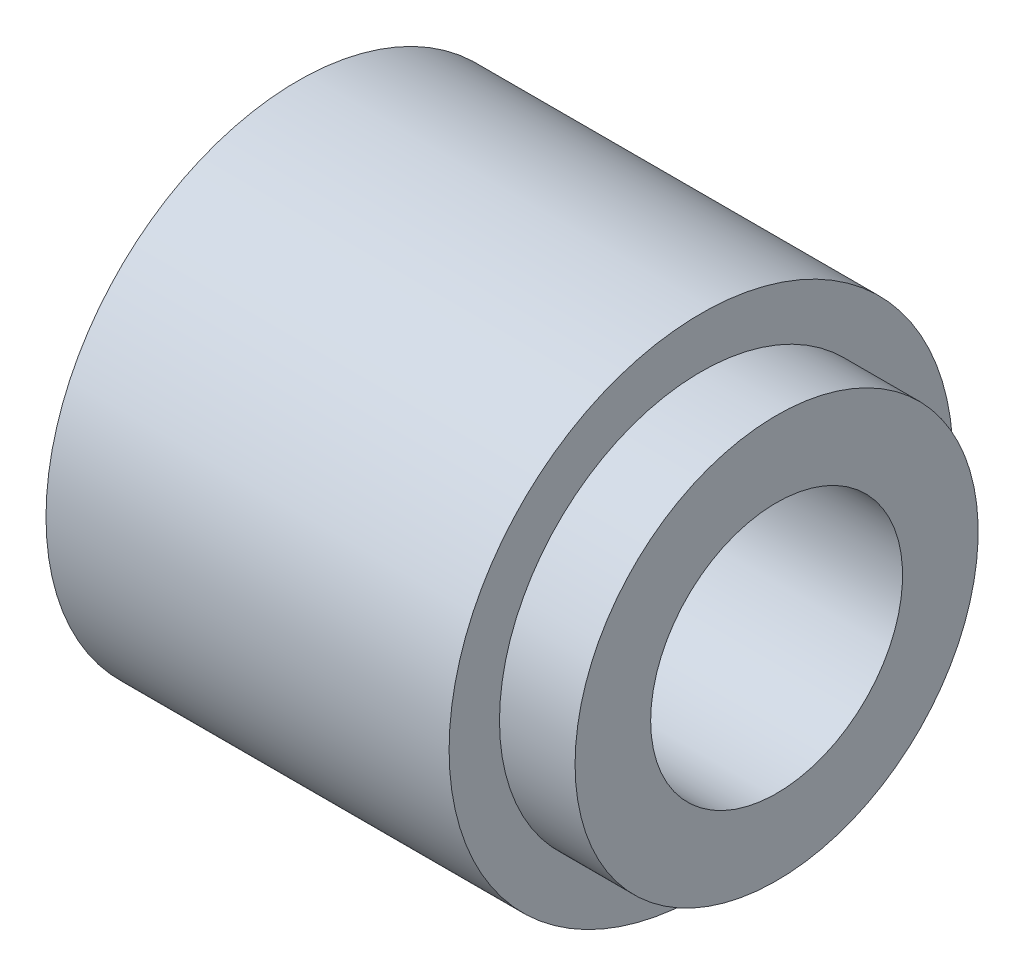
ISO-10303-21;
HEADER;
FILE_DESCRIPTION(('STEP AP214'),'2;1');
FILE_NAME('part.step','',(''),(''),'','','');
FILE_SCHEMA(('AUTOMOTIVE_DESIGN { 1 0 10303 214 1 1 1 1 }'));
ENDSEC;
DATA;
#1=APPLICATION_CONTEXT('core data for automotive mechanical design processes');
#2=APPLICATION_PROTOCOL_DEFINITION('international standard','automotive_design',2000,#1);
#3=PRODUCT_CONTEXT('',#1,'mechanical');
#4=PRODUCT('Part','Part','',(#3));
#5=PRODUCT_RELATED_PRODUCT_CATEGORY('part','',(#4));
#6=PRODUCT_DEFINITION_FORMATION('','',#4);
#7=PRODUCT_DEFINITION_CONTEXT('part definition',#1,'design');
#8=PRODUCT_DEFINITION('design','',#6,#7);
#9=PRODUCT_DEFINITION_SHAPE('','',#8);
#10=(LENGTH_UNIT() NAMED_UNIT(*) SI_UNIT(.MILLI.,.METRE.));
#11=(NAMED_UNIT(*) PLANE_ANGLE_UNIT() SI_UNIT($,.RADIAN.));
#12=(NAMED_UNIT(*) SI_UNIT($,.STERADIAN.) SOLID_ANGLE_UNIT());
#13=UNCERTAINTY_MEASURE_WITH_UNIT(LENGTH_MEASURE(1.E-05),#10,'distance_accuracy_value','');
#14=(GEOMETRIC_REPRESENTATION_CONTEXT(3) GLOBAL_UNCERTAINTY_ASSIGNED_CONTEXT((#13)) GLOBAL_UNIT_ASSIGNED_CONTEXT((#10,
#11,#12)) REPRESENTATION_CONTEXT('',''));
#15=CARTESIAN_POINT('',(0.,0.,0.));
#16=DIRECTION('',(0.,0.,1.));
#17=DIRECTION('',(1.,0.,0.));
#18=AXIS2_PLACEMENT_3D('',#15,#16,#17);
#19=CARTESIAN_POINT('',(0.,-5.99164590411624,0.));
#20=DIRECTION('',(1.,0.,0.));
#21=DIRECTION('',(0.,0.,-1.));
#22=AXIS2_PLACEMENT_3D('',#19,#20,#21);
#23=PLANE('',#22);
#24=CARTESIAN_POINT('',(0.,0.,0.));
#25=DIRECTION('',(-1.,0.,0.));
#26=DIRECTION('',(0.,0.,1.));
#27=AXIS2_PLACEMENT_3D('',#24,#25,#26);
#28=CIRCLE('',#27,2.5);
#29=CARTESIAN_POINT('',(0.,0.,2.5));
#30=VERTEX_POINT('',#29);
#31=EDGE_CURVE('E10',#30,#30,#28,.T.);
#32=ORIENTED_EDGE('',*,*,#31,.F.);
#33=EDGE_LOOP('',(#32));
#34=FACE_BOUND('',#33,.T.);
#35=CARTESIAN_POINT('',(0.,0.,0.));
#36=DIRECTION('',(-1.,0.,0.));
#37=DIRECTION('',(0.,0.,1.));
#38=AXIS2_PLACEMENT_3D('',#35,#36,#37);
#39=CIRCLE('',#38,5.);
#40=CARTESIAN_POINT('',(0.,0.,5.));
#41=VERTEX_POINT('',#40);
#42=EDGE_CURVE('E52',#41,#41,#39,.T.);
#43=ORIENTED_EDGE('',*,*,#42,.T.);
#44=EDGE_LOOP('',(#43));
#45=FACE_BOUND('',#44,.T.);
#46=ADVANCED_FACE('F30',(#34,#45),#23,.F.);
#47=CARTESIAN_POINT('',(0.,0.,0.));
#48=DIRECTION('',(-1.,0.,0.));
#49=DIRECTION('',(0.,0.,1.));
#50=AXIS2_PLACEMENT_3D('',#47,#48,#49);
#51=CYLINDRICAL_SURFACE('',#50,2.5);
#52=CARTESIAN_POINT('',(9.5,0.,0.));
#53=DIRECTION('',(-1.,0.,0.));
#54=DIRECTION('',(0.,0.,1.));
#55=AXIS2_PLACEMENT_3D('',#52,#53,#54);
#56=CIRCLE('',#55,2.5);
#57=CARTESIAN_POINT('',(9.5,0.,2.5));
#58=VERTEX_POINT('',#57);
#59=EDGE_CURVE('E36',#58,#58,#56,.T.);
#60=ORIENTED_EDGE('',*,*,#59,.F.);
#61=EDGE_LOOP('',(#60));
#62=FACE_BOUND('',#61,.T.);
#63=ORIENTED_EDGE('',*,*,#31,.T.);
#64=EDGE_LOOP('',(#63));
#65=FACE_BOUND('',#64,.T.);
#66=ADVANCED_FACE('F77',(#62,#65),#51,.F.);
#67=CARTESIAN_POINT('',(9.5,-5.99164590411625,0.));
#68=DIRECTION('',(-1.,0.,0.));
#69=DIRECTION('',(0.,0.,1.));
#70=AXIS2_PLACEMENT_3D('',#67,#68,#69);
#71=PLANE('',#70);
#72=CARTESIAN_POINT('',(9.5,0.,0.));
#73=DIRECTION('',(-1.,0.,0.));
#74=DIRECTION('',(0.,0.,1.));
#75=AXIS2_PLACEMENT_3D('',#72,#73,#74);
#76=CIRCLE('',#75,4.);
#77=CARTESIAN_POINT('',(9.5,0.,4.));
#78=VERTEX_POINT('',#77);
#79=EDGE_CURVE('E40',#78,#78,#76,.T.);
#80=ORIENTED_EDGE('',*,*,#79,.F.);
#81=EDGE_LOOP('',(#80));
#82=FACE_BOUND('',#81,.T.);
#83=ORIENTED_EDGE('',*,*,#59,.T.);
#84=EDGE_LOOP('',(#83));
#85=FACE_BOUND('',#84,.T.);
#86=ADVANCED_FACE('F72',(#82,#85),#71,.F.);
#87=CARTESIAN_POINT('',(0.,0.,0.));
#88=DIRECTION('',(-1.,0.,0.));
#89=DIRECTION('',(0.,0.,1.));
#90=AXIS2_PLACEMENT_3D('',#87,#88,#89);
#91=CYLINDRICAL_SURFACE('',#90,4.);
#92=CARTESIAN_POINT('',(8.,0.,0.));
#93=DIRECTION('',(-1.,0.,0.));
#94=DIRECTION('',(0.,0.,1.));
#95=AXIS2_PLACEMENT_3D('',#92,#93,#94);
#96=CIRCLE('',#95,4.);
#97=CARTESIAN_POINT('',(8.,0.,4.));
#98=VERTEX_POINT('',#97);
#99=EDGE_CURVE('E44',#98,#98,#96,.T.);
#100=ORIENTED_EDGE('',*,*,#99,.F.);
#101=EDGE_LOOP('',(#100));
#102=FACE_BOUND('',#101,.T.);
#103=ORIENTED_EDGE('',*,*,#79,.T.);
#104=EDGE_LOOP('',(#103));
#105=FACE_BOUND('',#104,.T.);
#106=ADVANCED_FACE('F66',(#102,#105),#91,.T.);
#107=CARTESIAN_POINT('',(8.,-5.99164590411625,0.));
#108=DIRECTION('',(-1.,0.,0.));
#109=DIRECTION('',(0.,0.,1.));
#110=AXIS2_PLACEMENT_3D('',#107,#108,#109);
#111=PLANE('',#110);
#112=CARTESIAN_POINT('',(8.,0.,0.));
#113=DIRECTION('',(-1.,0.,0.));
#114=DIRECTION('',(0.,0.,1.));
#115=AXIS2_PLACEMENT_3D('',#112,#113,#114);
#116=CIRCLE('',#115,5.);
#117=CARTESIAN_POINT('',(8.,0.,5.));
#118=VERTEX_POINT('',#117);
#119=EDGE_CURVE('E49',#118,#118,#116,.T.);
#120=ORIENTED_EDGE('',*,*,#119,.F.);
#121=EDGE_LOOP('',(#120));
#122=FACE_BOUND('',#121,.T.);
#123=ORIENTED_EDGE('',*,*,#99,.T.);
#124=EDGE_LOOP('',(#123));
#125=FACE_BOUND('',#124,.T.);
#126=ADVANCED_FACE('F60',(#122,#125),#111,.F.);
#127=CARTESIAN_POINT('',(0.,0.,0.));
#128=DIRECTION('',(-1.,0.,0.));
#129=DIRECTION('',(0.,0.,1.));
#130=AXIS2_PLACEMENT_3D('',#127,#128,#129);
#131=CYLINDRICAL_SURFACE('',#130,5.);
#132=ORIENTED_EDGE('',*,*,#42,.F.);
#133=EDGE_LOOP('',(#132));
#134=FACE_BOUND('',#133,.T.);
#135=ORIENTED_EDGE('',*,*,#119,.T.);
#136=EDGE_LOOP('',(#135));
#137=FACE_BOUND('',#136,.T.);
#138=ADVANCED_FACE('F57',(#134,#137),#131,.T.);
#139=CLOSED_SHELL('',(#46,#66,#86,#106,#126,#138));
#140=MANIFOLD_SOLID_BREP('B2',#139);
#141=ADVANCED_BREP_SHAPE_REPRESENTATION('',(#18,#140),#14);
#142=SHAPE_DEFINITION_REPRESENTATION(#9,#141);
ENDSEC;
END-ISO-10303-21;
